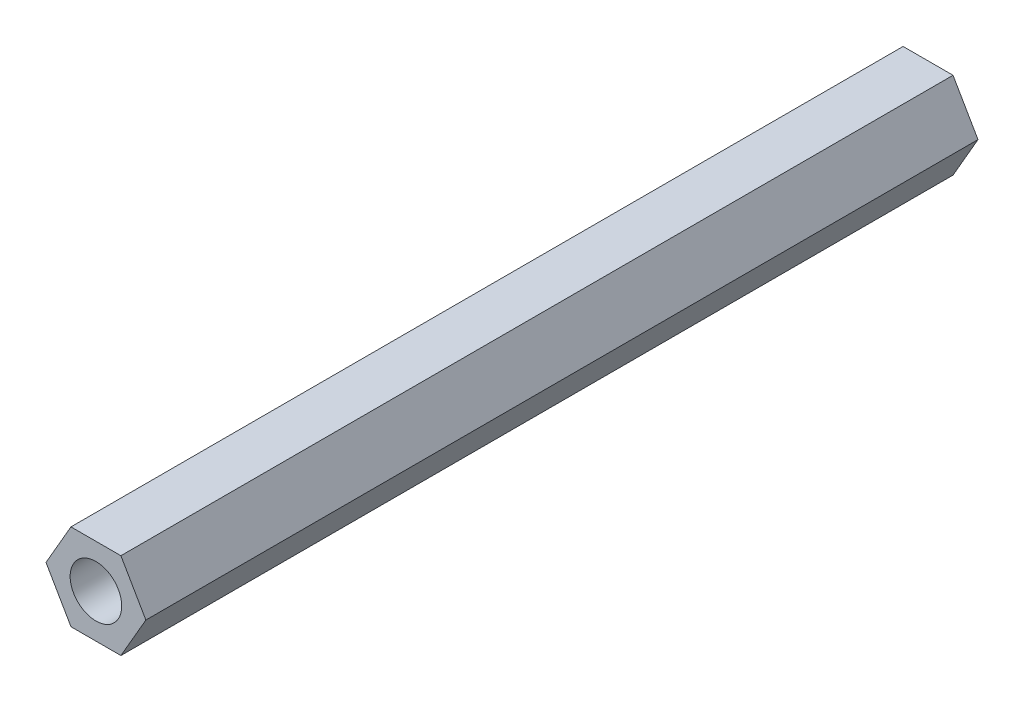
ISO-10303-21;
HEADER;
FILE_DESCRIPTION(('STEP AP214'),'2;1');
FILE_NAME('part.step','',(''),(''),'','','');
FILE_SCHEMA(('AUTOMOTIVE_DESIGN { 1 0 10303 214 1 1 1 1 }'));
ENDSEC;
DATA;
#1=APPLICATION_CONTEXT('core data for automotive mechanical design processes');
#2=APPLICATION_PROTOCOL_DEFINITION('international standard','automotive_design',2000,#1);
#3=PRODUCT_CONTEXT('',#1,'mechanical');
#4=PRODUCT('Part','Part','',(#3));
#5=PRODUCT_RELATED_PRODUCT_CATEGORY('part','',(#4));
#6=PRODUCT_DEFINITION_FORMATION('','',#4);
#7=PRODUCT_DEFINITION_CONTEXT('part definition',#1,'design');
#8=PRODUCT_DEFINITION('design','',#6,#7);
#9=PRODUCT_DEFINITION_SHAPE('','',#8);
#10=(LENGTH_UNIT() NAMED_UNIT(*) SI_UNIT(.MILLI.,.METRE.));
#11=(NAMED_UNIT(*) PLANE_ANGLE_UNIT() SI_UNIT($,.RADIAN.));
#12=(NAMED_UNIT(*) SI_UNIT($,.STERADIAN.) SOLID_ANGLE_UNIT());
#13=UNCERTAINTY_MEASURE_WITH_UNIT(LENGTH_MEASURE(1.E-05),#10,'distance_accuracy_value','');
#14=(GEOMETRIC_REPRESENTATION_CONTEXT(3) GLOBAL_UNCERTAINTY_ASSIGNED_CONTEXT((#13)) GLOBAL_UNIT_ASSIGNED_CONTEXT((#10,
#11,#12)) REPRESENTATION_CONTEXT('',''));
#15=CARTESIAN_POINT('',(0.,0.,0.));
#16=DIRECTION('',(0.,0.,1.));
#17=DIRECTION('',(1.,0.,0.));
#18=AXIS2_PLACEMENT_3D('',#15,#16,#17);
#19=CARTESIAN_POINT('',(0.,0.,50.));
#20=DIRECTION('',(0.,0.,1.));
#21=DIRECTION('',(1.,0.,0.));
#22=AXIS2_PLACEMENT_3D('',#19,#20,#21);
#23=PLANE('',#22);
#24=DIRECTION('',(0.5,0.866025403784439,0.));
#25=VECTOR('',#24,1.);
#26=CARTESIAN_POINT('',(1.5,-2.59807621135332,50.));
#27=LINE('',#26,#25);
#28=CARTESIAN_POINT('',(1.5,-2.59807621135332,50.));
#29=VERTEX_POINT('',#28);
#30=CARTESIAN_POINT('',(3.,0.,50.));
#31=VERTEX_POINT('',#30);
#32=EDGE_CURVE('E146',#29,#31,#27,.T.);
#33=ORIENTED_EDGE('',*,*,#32,.T.);
#34=DIRECTION('',(-0.5,0.866025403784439,0.));
#35=VECTOR('',#34,1.);
#36=CARTESIAN_POINT('',(3.,0.,50.));
#37=LINE('',#36,#35);
#38=CARTESIAN_POINT('',(1.5,2.59807621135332,50.));
#39=VERTEX_POINT('',#38);
#40=EDGE_CURVE('E94',#31,#39,#37,.T.);
#41=ORIENTED_EDGE('',*,*,#40,.T.);
#42=DIRECTION('',(-1.,0.,0.));
#43=VECTOR('',#42,1.);
#44=CARTESIAN_POINT('',(1.5,2.59807621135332,50.));
#45=LINE('',#44,#43);
#46=CARTESIAN_POINT('',(-1.5,2.59807621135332,50.));
#47=VERTEX_POINT('',#46);
#48=EDGE_CURVE('E107',#39,#47,#45,.T.);
#49=ORIENTED_EDGE('',*,*,#48,.T.);
#50=DIRECTION('',(-0.5,-0.866025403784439,0.));
#51=VECTOR('',#50,1.);
#52=CARTESIAN_POINT('',(-1.5,2.59807621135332,50.));
#53=LINE('',#52,#51);
#54=CARTESIAN_POINT('',(-3.,0.,50.));
#55=VERTEX_POINT('',#54);
#56=EDGE_CURVE('E101',#47,#55,#53,.T.);
#57=ORIENTED_EDGE('',*,*,#56,.T.);
#58=DIRECTION('',(0.5,-0.866025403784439,0.));
#59=VECTOR('',#58,1.);
#60=CARTESIAN_POINT('',(-3.,0.,50.));
#61=LINE('',#60,#59);
#62=CARTESIAN_POINT('',(-1.5,-2.59807621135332,50.));
#63=VERTEX_POINT('',#62);
#64=EDGE_CURVE('E105',#55,#63,#61,.T.);
#65=ORIENTED_EDGE('',*,*,#64,.T.);
#66=DIRECTION('',(1.,0.,0.));
#67=VECTOR('',#66,1.);
#68=CARTESIAN_POINT('',(-1.5,-2.59807621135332,50.));
#69=LINE('',#68,#67);
#70=EDGE_CURVE('E57',#63,#29,#69,.T.);
#71=ORIENTED_EDGE('',*,*,#70,.T.);
#72=EDGE_LOOP('',(#33,#41,#49,#57,#65,#71));
#73=FACE_BOUND('',#72,.T.);
#74=CARTESIAN_POINT('',(0.,0.,50.));
#75=DIRECTION('',(0.,0.,1.));
#76=DIRECTION('',(1.,0.,0.));
#77=AXIS2_PLACEMENT_3D('',#74,#75,#76);
#78=CIRCLE('',#77,1.55);
#79=CARTESIAN_POINT('',(1.55,0.,50.));
#80=VERTEX_POINT('',#79);
#81=EDGE_CURVE('E134',#80,#80,#78,.T.);
#82=ORIENTED_EDGE('',*,*,#81,.F.);
#83=EDGE_LOOP('',(#82));
#84=FACE_BOUND('',#83,.T.);
#85=ADVANCED_FACE('F39',(#73,#84),#23,.T.);
#86=CARTESIAN_POINT('',(0.,0.,0.));
#87=DIRECTION('',(0.,0.,1.));
#88=DIRECTION('',(1.,0.,0.));
#89=AXIS2_PLACEMENT_3D('',#86,#87,#88);
#90=PLANE('',#89);
#91=DIRECTION('',(0.5,0.866025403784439,0.));
#92=VECTOR('',#91,1.);
#93=CARTESIAN_POINT('',(1.5,-2.59807621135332,0.));
#94=LINE('',#93,#92);
#95=CARTESIAN_POINT('',(1.5,-2.59807621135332,0.));
#96=VERTEX_POINT('',#95);
#97=CARTESIAN_POINT('',(3.,0.,0.));
#98=VERTEX_POINT('',#97);
#99=EDGE_CURVE('E129',#96,#98,#94,.T.);
#100=ORIENTED_EDGE('',*,*,#99,.F.);
#101=DIRECTION('',(1.,0.,0.));
#102=VECTOR('',#101,1.);
#103=CARTESIAN_POINT('',(-1.5,-2.59807621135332,0.));
#104=LINE('',#103,#102);
#105=CARTESIAN_POINT('',(-1.5,-2.59807621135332,0.));
#106=VERTEX_POINT('',#105);
#107=EDGE_CURVE('E86',#106,#96,#104,.T.);
#108=ORIENTED_EDGE('',*,*,#107,.F.);
#109=DIRECTION('',(0.5,-0.866025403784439,0.));
#110=VECTOR('',#109,1.);
#111=CARTESIAN_POINT('',(-3.,0.,0.));
#112=LINE('',#111,#110);
#113=CARTESIAN_POINT('',(-3.,0.,0.));
#114=VERTEX_POINT('',#113);
#115=EDGE_CURVE('E80',#114,#106,#112,.T.);
#116=ORIENTED_EDGE('',*,*,#115,.F.);
#117=DIRECTION('',(-0.5,-0.866025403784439,0.));
#118=VECTOR('',#117,1.);
#119=CARTESIAN_POINT('',(-1.5,2.59807621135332,0.));
#120=LINE('',#119,#118);
#121=CARTESIAN_POINT('',(-1.5,2.59807621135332,0.));
#122=VERTEX_POINT('',#121);
#123=EDGE_CURVE('E116',#122,#114,#120,.T.);
#124=ORIENTED_EDGE('',*,*,#123,.F.);
#125=DIRECTION('',(-1.,0.,0.));
#126=VECTOR('',#125,1.);
#127=CARTESIAN_POINT('',(1.5,2.59807621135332,0.));
#128=LINE('',#127,#126);
#129=CARTESIAN_POINT('',(1.5,2.59807621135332,0.));
#130=VERTEX_POINT('',#129);
#131=EDGE_CURVE('E137',#130,#122,#128,.T.);
#132=ORIENTED_EDGE('',*,*,#131,.F.);
#133=DIRECTION('',(-0.5,0.866025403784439,0.));
#134=VECTOR('',#133,1.);
#135=CARTESIAN_POINT('',(3.,0.,0.));
#136=LINE('',#135,#134);
#137=EDGE_CURVE('E133',#98,#130,#136,.T.);
#138=ORIENTED_EDGE('',*,*,#137,.F.);
#139=EDGE_LOOP('',(#100,#108,#116,#124,#132,#138));
#140=FACE_BOUND('',#139,.T.);
#141=CARTESIAN_POINT('',(0.,0.,0.));
#142=DIRECTION('',(0.,0.,1.));
#143=DIRECTION('',(1.,0.,0.));
#144=AXIS2_PLACEMENT_3D('',#141,#142,#143);
#145=CIRCLE('',#144,1.55);
#146=CARTESIAN_POINT('',(1.55,0.,0.));
#147=VERTEX_POINT('',#146);
#148=EDGE_CURVE('E243',#147,#147,#145,.T.);
#149=ORIENTED_EDGE('',*,*,#148,.T.);
#150=EDGE_LOOP('',(#149));
#151=FACE_BOUND('',#150,.T.);
#152=ADVANCED_FACE('F159',(#140,#151),#90,.F.);
#153=CARTESIAN_POINT('',(1.5,-2.59807621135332,50.));
#154=DIRECTION('',(-0.866025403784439,0.5,0.));
#155=DIRECTION('',(-0.5,-0.866025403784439,0.));
#156=AXIS2_PLACEMENT_3D('',#153,#154,#155);
#157=PLANE('',#156);
#158=ORIENTED_EDGE('',*,*,#99,.T.);
#159=DIRECTION('',(0.,0.,-1.));
#160=VECTOR('',#159,1.);
#161=CARTESIAN_POINT('',(3.,0.,50.));
#162=LINE('',#161,#160);
#163=EDGE_CURVE('E11',#31,#98,#162,.T.);
#164=ORIENTED_EDGE('',*,*,#163,.F.);
#165=ORIENTED_EDGE('',*,*,#32,.F.);
#166=DIRECTION('',(0.,0.,-1.));
#167=VECTOR('',#166,1.);
#168=CARTESIAN_POINT('',(1.5,-2.59807621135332,50.));
#169=LINE('',#168,#167);
#170=EDGE_CURVE('E125',#29,#96,#169,.T.);
#171=ORIENTED_EDGE('',*,*,#170,.T.);
#172=EDGE_LOOP('',(#158,#164,#165,#171));
#173=FACE_BOUND('',#172,.T.);
#174=ADVANCED_FACE('F41',(#173),#157,.F.);
#175=CARTESIAN_POINT('',(3.,0.,50.));
#176=DIRECTION('',(-0.866025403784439,-0.5,0.));
#177=DIRECTION('',(0.5,-0.866025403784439,0.));
#178=AXIS2_PLACEMENT_3D('',#175,#176,#177);
#179=PLANE('',#178);
#180=ORIENTED_EDGE('',*,*,#137,.T.);
#181=DIRECTION('',(0.,0.,-1.));
#182=VECTOR('',#181,1.);
#183=CARTESIAN_POINT('',(1.5,2.59807621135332,50.));
#184=LINE('',#183,#182);
#185=EDGE_CURVE('E49',#39,#130,#184,.T.);
#186=ORIENTED_EDGE('',*,*,#185,.F.);
#187=ORIENTED_EDGE('',*,*,#40,.F.);
#188=ORIENTED_EDGE('',*,*,#163,.T.);
#189=EDGE_LOOP('',(#180,#186,#187,#188));
#190=FACE_BOUND('',#189,.T.);
#191=ADVANCED_FACE('F184',(#190),#179,.F.);
#192=CARTESIAN_POINT('',(1.5,2.59807621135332,50.));
#193=DIRECTION('',(0.,-1.,0.));
#194=DIRECTION('',(0.,0.,-1.));
#195=AXIS2_PLACEMENT_3D('',#192,#193,#194);
#196=PLANE('',#195);
#197=ORIENTED_EDGE('',*,*,#131,.T.);
#198=DIRECTION('',(0.,0.,-1.));
#199=VECTOR('',#198,1.);
#200=CARTESIAN_POINT('',(-1.5,2.59807621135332,50.));
#201=LINE('',#200,#199);
#202=EDGE_CURVE('E118',#47,#122,#201,.T.);
#203=ORIENTED_EDGE('',*,*,#202,.F.);
#204=ORIENTED_EDGE('',*,*,#48,.F.);
#205=ORIENTED_EDGE('',*,*,#185,.T.);
#206=EDGE_LOOP('',(#197,#203,#204,#205));
#207=FACE_BOUND('',#206,.T.);
#208=ADVANCED_FACE('F156',(#207),#196,.F.);
#209=CARTESIAN_POINT('',(-1.5,2.59807621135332,50.));
#210=DIRECTION('',(0.866025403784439,-0.5,0.));
#211=DIRECTION('',(0.5,0.866025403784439,0.));
#212=AXIS2_PLACEMENT_3D('',#209,#210,#211);
#213=PLANE('',#212);
#214=ORIENTED_EDGE('',*,*,#123,.T.);
#215=DIRECTION('',(0.,0.,-1.));
#216=VECTOR('',#215,1.);
#217=CARTESIAN_POINT('',(-3.,0.,50.));
#218=LINE('',#217,#216);
#219=EDGE_CURVE('E113',#55,#114,#218,.T.);
#220=ORIENTED_EDGE('',*,*,#219,.F.);
#221=ORIENTED_EDGE('',*,*,#56,.F.);
#222=ORIENTED_EDGE('',*,*,#202,.T.);
#223=EDGE_LOOP('',(#214,#220,#221,#222));
#224=FACE_BOUND('',#223,.T.);
#225=ADVANCED_FACE('F114',(#224),#213,.F.);
#226=CARTESIAN_POINT('',(-3.,0.,50.));
#227=DIRECTION('',(0.866025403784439,0.5,0.));
#228=DIRECTION('',(-0.5,0.866025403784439,0.));
#229=AXIS2_PLACEMENT_3D('',#226,#227,#228);
#230=PLANE('',#229);
#231=ORIENTED_EDGE('',*,*,#115,.T.);
#232=DIRECTION('',(0.,0.,-1.));
#233=VECTOR('',#232,1.);
#234=CARTESIAN_POINT('',(-1.5,-2.59807621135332,50.));
#235=LINE('',#234,#233);
#236=EDGE_CURVE('E119',#63,#106,#235,.T.);
#237=ORIENTED_EDGE('',*,*,#236,.F.);
#238=ORIENTED_EDGE('',*,*,#64,.F.);
#239=ORIENTED_EDGE('',*,*,#219,.T.);
#240=EDGE_LOOP('',(#231,#237,#238,#239));
#241=FACE_BOUND('',#240,.T.);
#242=ADVANCED_FACE('F121',(#241),#230,.F.);
#243=CARTESIAN_POINT('',(-1.5,-2.59807621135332,50.));
#244=DIRECTION('',(0.,1.,0.));
#245=DIRECTION('',(-1.,0.,0.));
#246=AXIS2_PLACEMENT_3D('',#243,#244,#245);
#247=PLANE('',#246);
#248=ORIENTED_EDGE('',*,*,#107,.T.);
#249=ORIENTED_EDGE('',*,*,#170,.F.);
#250=ORIENTED_EDGE('',*,*,#70,.F.);
#251=ORIENTED_EDGE('',*,*,#236,.T.);
#252=EDGE_LOOP('',(#248,#249,#250,#251));
#253=FACE_BOUND('',#252,.T.);
#254=ADVANCED_FACE('F164',(#253),#247,.F.);
#255=CARTESIAN_POINT('',(0.,0.,50.));
#256=DIRECTION('',(0.,0.,-1.));
#257=DIRECTION('',(-1.,0.,0.));
#258=AXIS2_PLACEMENT_3D('',#255,#256,#257);
#259=CYLINDRICAL_SURFACE('',#258,1.55);
#260=ORIENTED_EDGE('',*,*,#81,.T.);
#261=EDGE_LOOP('',(#260));
#262=FACE_BOUND('',#261,.T.);
#263=ORIENTED_EDGE('',*,*,#148,.F.);
#264=EDGE_LOOP('',(#263));
#265=FACE_BOUND('',#264,.T.);
#266=ADVANCED_FACE('F166',(#262,#265),#259,.F.);
#267=CLOSED_SHELL('',(#85,#152,#174,#191,#208,#225,#242,#254,#266));
#268=MANIFOLD_SOLID_BREP('B2',#267);
#269=ADVANCED_BREP_SHAPE_REPRESENTATION('',(#18,#268),#14);
#270=SHAPE_DEFINITION_REPRESENTATION(#9,#269);
ENDSEC;
END-ISO-10303-21;
